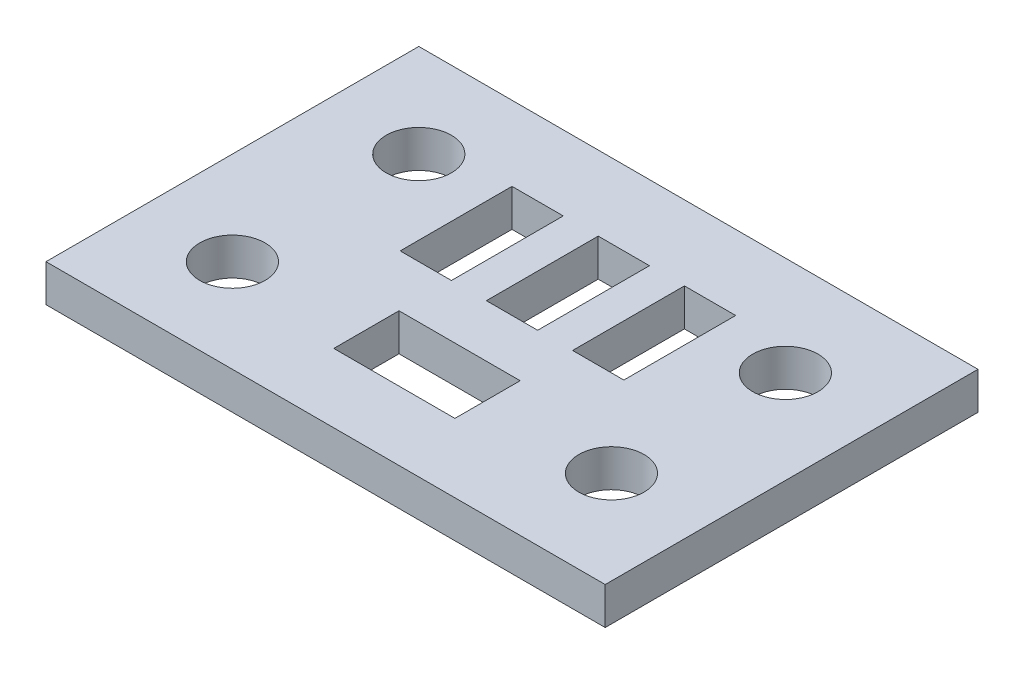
ISO-10303-21;
HEADER;
FILE_DESCRIPTION(('STEP AP214'),'2;1');
FILE_NAME('part.step','',(''),(''),'','','');
FILE_SCHEMA(('AUTOMOTIVE_DESIGN { 1 0 10303 214 1 1 1 1 }'));
ENDSEC;
DATA;
#1=APPLICATION_CONTEXT('core data for automotive mechanical design processes');
#2=APPLICATION_PROTOCOL_DEFINITION('international standard','automotive_design',2000,#1);
#3=PRODUCT_CONTEXT('',#1,'mechanical');
#4=PRODUCT('Part','Part','',(#3));
#5=PRODUCT_RELATED_PRODUCT_CATEGORY('part','',(#4));
#6=PRODUCT_DEFINITION_FORMATION('','',#4);
#7=PRODUCT_DEFINITION_CONTEXT('part definition',#1,'design');
#8=PRODUCT_DEFINITION('design','',#6,#7);
#9=PRODUCT_DEFINITION_SHAPE('','',#8);
#10=(LENGTH_UNIT() NAMED_UNIT(*) SI_UNIT(.MILLI.,.METRE.));
#11=(NAMED_UNIT(*) PLANE_ANGLE_UNIT() SI_UNIT($,.RADIAN.));
#12=(NAMED_UNIT(*) SI_UNIT($,.STERADIAN.) SOLID_ANGLE_UNIT());
#13=UNCERTAINTY_MEASURE_WITH_UNIT(LENGTH_MEASURE(1.E-05),#10,'distance_accuracy_value','');
#14=(GEOMETRIC_REPRESENTATION_CONTEXT(3) GLOBAL_UNCERTAINTY_ASSIGNED_CONTEXT((#13)) GLOBAL_UNIT_ASSIGNED_CONTEXT((#10,
#11,#12)) REPRESENTATION_CONTEXT('',''));
#15=CARTESIAN_POINT('',(0.,0.,0.));
#16=DIRECTION('',(0.,0.,1.));
#17=DIRECTION('',(1.,0.,0.));
#18=AXIS2_PLACEMENT_3D('',#15,#16,#17);
#19=CARTESIAN_POINT('',(0.,2.,0.));
#20=DIRECTION('',(0.,-1.,0.));
#21=DIRECTION('',(0.,0.,-1.));
#22=AXIS2_PLACEMENT_3D('',#19,#20,#21);
#23=PLANE('',#22);
#24=DIRECTION('',(0.,0.,1.));
#25=VECTOR('',#24,1.);
#26=CARTESIAN_POINT('',(11.75,2.,-7.18797813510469));
#27=LINE('',#26,#25);
#28=CARTESIAN_POINT('',(11.75,2.,-7.18797813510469));
#29=VERTEX_POINT('',#28);
#30=CARTESIAN_POINT('',(11.75,2.,-3.68797813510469));
#31=VERTEX_POINT('',#30);
#32=EDGE_CURVE('E206',#29,#31,#27,.T.);
#33=ORIENTED_EDGE('',*,*,#32,.F.);
#34=DIRECTION('',(-1.,0.,0.));
#35=VECTOR('',#34,1.);
#36=CARTESIAN_POINT('',(11.75,2.,-7.18797813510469));
#37=LINE('',#36,#35);
#38=CARTESIAN_POINT('',(18.25,2.,-7.18797813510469));
#39=VERTEX_POINT('',#38);
#40=EDGE_CURVE('E214',#39,#29,#37,.T.);
#41=ORIENTED_EDGE('',*,*,#40,.F.);
#42=DIRECTION('',(0.,0.,-1.));
#43=VECTOR('',#42,1.);
#44=CARTESIAN_POINT('',(18.25,2.,-7.18797813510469));
#45=LINE('',#44,#43);
#46=CARTESIAN_POINT('',(18.25,2.,-3.68797813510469));
#47=VERTEX_POINT('',#46);
#48=EDGE_CURVE('E211',#47,#39,#45,.T.);
#49=ORIENTED_EDGE('',*,*,#48,.F.);
#50=DIRECTION('',(1.,0.,0.));
#51=VECTOR('',#50,1.);
#52=CARTESIAN_POINT('',(11.75,2.,-3.68797813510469));
#53=LINE('',#52,#51);
#54=EDGE_CURVE('E208',#31,#47,#53,.T.);
#55=ORIENTED_EDGE('',*,*,#54,.F.);
#56=EDGE_LOOP('',(#33,#41,#49,#55));
#57=FACE_BOUND('',#56,.T.);
#58=DIRECTION('',(-1.,0.,0.));
#59=VECTOR('',#58,1.);
#60=CARTESIAN_POINT('',(9.,2.,-16.));
#61=LINE('',#60,#59);
#62=CARTESIAN_POINT('',(11.75,2.,-16.));
#63=VERTEX_POINT('',#62);
#64=CARTESIAN_POINT('',(9.,2.,-16.));
#65=VERTEX_POINT('',#64);
#66=EDGE_CURVE('E268',#63,#65,#61,.T.);
#67=ORIENTED_EDGE('',*,*,#66,.F.);
#68=DIRECTION('',(0.,0.,-1.));
#69=VECTOR('',#68,1.);
#70=CARTESIAN_POINT('',(11.75,2.,-10.));
#71=LINE('',#70,#69);
#72=CARTESIAN_POINT('',(11.75,2.,-10.));
#73=VERTEX_POINT('',#72);
#74=EDGE_CURVE('E276',#73,#63,#71,.T.);
#75=ORIENTED_EDGE('',*,*,#74,.F.);
#76=DIRECTION('',(1.,0.,0.));
#77=VECTOR('',#76,1.);
#78=CARTESIAN_POINT('',(11.75,2.,-10.));
#79=LINE('',#78,#77);
#80=CARTESIAN_POINT('',(9.,2.,-10.));
#81=VERTEX_POINT('',#80);
#82=EDGE_CURVE('E273',#81,#73,#79,.T.);
#83=ORIENTED_EDGE('',*,*,#82,.F.);
#84=DIRECTION('',(0.,0.,1.));
#85=VECTOR('',#84,1.);
#86=CARTESIAN_POINT('',(9.,2.,-10.));
#87=LINE('',#86,#85);
#88=EDGE_CURVE('E270',#65,#81,#87,.T.);
#89=ORIENTED_EDGE('',*,*,#88,.F.);
#90=EDGE_LOOP('',(#67,#75,#83,#89));
#91=FACE_BOUND('',#90,.T.);
#92=CARTESIAN_POINT('',(25.,2.,-5.33441582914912));
#93=DIRECTION('',(0.,1.,0.));
#94=DIRECTION('',(0.,0.,1.));
#95=AXIS2_PLACEMENT_3D('',#92,#93,#94);
#96=CIRCLE('',#95,1.75);
#97=CARTESIAN_POINT('',(25.,2.,-3.58441582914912));
#98=VERTEX_POINT('',#97);
#99=EDGE_CURVE('E305',#98,#98,#96,.T.);
#100=ORIENTED_EDGE('',*,*,#99,.F.);
#101=EDGE_LOOP('',(#100));
#102=FACE_BOUND('',#101,.T.);
#103=CARTESIAN_POINT('',(5.,2.,-15.));
#104=DIRECTION('',(0.,1.,0.));
#105=DIRECTION('',(0.,0.,1.));
#106=AXIS2_PLACEMENT_3D('',#103,#104,#105);
#107=CIRCLE('',#106,1.75);
#108=CARTESIAN_POINT('',(5.,2.,-13.25));
#109=VERTEX_POINT('',#108);
#110=EDGE_CURVE('E317',#109,#109,#107,.T.);
#111=ORIENTED_EDGE('',*,*,#110,.F.);
#112=EDGE_LOOP('',(#111));
#113=FACE_BOUND('',#112,.T.);
#114=DIRECTION('',(0.,0.,1.));
#115=VECTOR('',#114,1.);
#116=CARTESIAN_POINT('',(0.,2.,0.));
#117=LINE('',#116,#115);
#118=CARTESIAN_POINT('',(0.,2.,-20.));
#119=VERTEX_POINT('',#118);
#120=CARTESIAN_POINT('',(0.,2.,0.));
#121=VERTEX_POINT('',#120);
#122=EDGE_CURVE('E323',#119,#121,#117,.T.);
#123=ORIENTED_EDGE('',*,*,#122,.T.);
#124=DIRECTION('',(1.,0.,0.));
#125=VECTOR('',#124,1.);
#126=CARTESIAN_POINT('',(0.,2.,0.));
#127=LINE('',#126,#125);
#128=CARTESIAN_POINT('',(30.,2.,0.));
#129=VERTEX_POINT('',#128);
#130=EDGE_CURVE('E326',#121,#129,#127,.T.);
#131=ORIENTED_EDGE('',*,*,#130,.T.);
#132=DIRECTION('',(0.,0.,-1.));
#133=VECTOR('',#132,1.);
#134=CARTESIAN_POINT('',(30.,2.,0.));
#135=LINE('',#134,#133);
#136=CARTESIAN_POINT('',(30.,2.,-20.));
#137=VERTEX_POINT('',#136);
#138=EDGE_CURVE('E329',#129,#137,#135,.T.);
#139=ORIENTED_EDGE('',*,*,#138,.T.);
#140=DIRECTION('',(-1.,0.,0.));
#141=VECTOR('',#140,1.);
#142=CARTESIAN_POINT('',(0.,2.,-20.));
#143=LINE('',#142,#141);
#144=EDGE_CURVE('E331',#137,#119,#143,.T.);
#145=ORIENTED_EDGE('',*,*,#144,.T.);
#146=EDGE_LOOP('',(#123,#131,#139,#145));
#147=FACE_BOUND('',#146,.T.);
#148=CARTESIAN_POINT('',(25.,2.,-14.6655841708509));
#149=DIRECTION('',(0.,1.,0.));
#150=DIRECTION('',(0.,0.,-1.));
#151=AXIS2_PLACEMENT_3D('',#148,#149,#150);
#152=CIRCLE('',#151,1.75);
#153=CARTESIAN_POINT('',(25.,2.,-16.4155841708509));
#154=VERTEX_POINT('',#153);
#155=EDGE_CURVE('E311',#154,#154,#152,.T.);
#156=ORIENTED_EDGE('',*,*,#155,.F.);
#157=EDGE_LOOP('',(#156));
#158=FACE_BOUND('',#157,.T.);
#159=CARTESIAN_POINT('',(5.,2.,-5.));
#160=DIRECTION('',(0.,1.,0.));
#161=DIRECTION('',(0.,0.,-1.));
#162=AXIS2_PLACEMENT_3D('',#159,#160,#161);
#163=CIRCLE('',#162,1.75);
#164=CARTESIAN_POINT('',(5.,2.,-6.75));
#165=VERTEX_POINT('',#164);
#166=EDGE_CURVE('E299',#165,#165,#163,.T.);
#167=ORIENTED_EDGE('',*,*,#166,.F.);
#168=EDGE_LOOP('',(#167));
#169=FACE_BOUND('',#168,.T.);
#170=DIRECTION('',(1.,0.,0.));
#171=VECTOR('',#170,1.);
#172=CARTESIAN_POINT('',(18.25,2.,-10.));
#173=LINE('',#172,#171);
#174=CARTESIAN_POINT('',(18.25,2.,-10.));
#175=VERTEX_POINT('',#174);
#176=CARTESIAN_POINT('',(21.,2.,-10.));
#177=VERTEX_POINT('',#176);
#178=EDGE_CURVE('E237',#175,#177,#173,.T.);
#179=ORIENTED_EDGE('',*,*,#178,.F.);
#180=DIRECTION('',(0.,0.,1.));
#181=VECTOR('',#180,1.);
#182=CARTESIAN_POINT('',(18.25,2.,-10.));
#183=LINE('',#182,#181);
#184=CARTESIAN_POINT('',(18.25,2.,-16.));
#185=VERTEX_POINT('',#184);
#186=EDGE_CURVE('E245',#185,#175,#183,.T.);
#187=ORIENTED_EDGE('',*,*,#186,.F.);
#188=DIRECTION('',(-1.,0.,0.));
#189=VECTOR('',#188,1.);
#190=CARTESIAN_POINT('',(18.25,2.,-16.));
#191=LINE('',#190,#189);
#192=CARTESIAN_POINT('',(21.,2.,-16.));
#193=VERTEX_POINT('',#192);
#194=EDGE_CURVE('E242',#193,#185,#191,.T.);
#195=ORIENTED_EDGE('',*,*,#194,.F.);
#196=DIRECTION('',(0.,0.,-1.));
#197=VECTOR('',#196,1.);
#198=CARTESIAN_POINT('',(21.,2.,-16.));
#199=LINE('',#198,#197);
#200=EDGE_CURVE('E239',#177,#193,#199,.T.);
#201=ORIENTED_EDGE('',*,*,#200,.F.);
#202=EDGE_LOOP('',(#179,#187,#195,#201));
#203=FACE_BOUND('',#202,.T.);
#204=DIRECTION('',(1.,0.,0.));
#205=VECTOR('',#204,1.);
#206=CARTESIAN_POINT('',(13.625,2.,-10.));
#207=LINE('',#206,#205);
#208=CARTESIAN_POINT('',(13.625,2.,-10.));
#209=VERTEX_POINT('',#208);
#210=CARTESIAN_POINT('',(16.375,2.,-10.));
#211=VERTEX_POINT('',#210);
#212=EDGE_CURVE('E170',#209,#211,#207,.T.);
#213=ORIENTED_EDGE('',*,*,#212,.F.);
#214=DIRECTION('',(0.,0.,1.));
#215=VECTOR('',#214,1.);
#216=CARTESIAN_POINT('',(13.625,2.,-10.));
#217=LINE('',#216,#215);
#218=CARTESIAN_POINT('',(13.625,2.,-16.));
#219=VERTEX_POINT('',#218);
#220=EDGE_CURVE('E192',#219,#209,#217,.T.);
#221=ORIENTED_EDGE('',*,*,#220,.F.);
#222=DIRECTION('',(-1.,0.,0.));
#223=VECTOR('',#222,1.);
#224=CARTESIAN_POINT('',(13.625,2.,-16.));
#225=LINE('',#224,#223);
#226=CARTESIAN_POINT('',(16.375,2.,-16.));
#227=VERTEX_POINT('',#226);
#228=EDGE_CURVE('E190',#227,#219,#225,.T.);
#229=ORIENTED_EDGE('',*,*,#228,.F.);
#230=DIRECTION('',(0.,0.,-1.));
#231=VECTOR('',#230,1.);
#232=CARTESIAN_POINT('',(16.375,2.,-10.));
#233=LINE('',#232,#231);
#234=EDGE_CURVE('E178',#211,#227,#233,.T.);
#235=ORIENTED_EDGE('',*,*,#234,.F.);
#236=EDGE_LOOP('',(#213,#221,#229,#235));
#237=FACE_BOUND('',#236,.T.);
#238=ADVANCED_FACE('F33',(#57,#91,#102,#113,#147,#158,#169,#203,#237),#23,.F.);
#239=CARTESIAN_POINT('',(0.,0.,0.));
#240=DIRECTION('',(0.,-1.,0.));
#241=DIRECTION('',(0.,0.,-1.));
#242=AXIS2_PLACEMENT_3D('',#239,#240,#241);
#243=PLANE('',#242);
#244=DIRECTION('',(-1.,0.,0.));
#245=VECTOR('',#244,1.);
#246=CARTESIAN_POINT('',(11.75,0.,-7.18797813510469));
#247=LINE('',#246,#245);
#248=CARTESIAN_POINT('',(18.25,0.,-7.18797813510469));
#249=VERTEX_POINT('',#248);
#250=CARTESIAN_POINT('',(11.75,0.,-7.18797813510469));
#251=VERTEX_POINT('',#250);
#252=EDGE_CURVE('E209',#249,#251,#247,.T.);
#253=ORIENTED_EDGE('',*,*,#252,.T.);
#254=DIRECTION('',(0.,0.,1.));
#255=VECTOR('',#254,1.);
#256=CARTESIAN_POINT('',(11.75,0.,-7.18797813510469));
#257=LINE('',#256,#255);
#258=CARTESIAN_POINT('',(11.75,0.,-3.68797813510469));
#259=VERTEX_POINT('',#258);
#260=EDGE_CURVE('E186',#251,#259,#257,.T.);
#261=ORIENTED_EDGE('',*,*,#260,.T.);
#262=DIRECTION('',(1.,0.,0.));
#263=VECTOR('',#262,1.);
#264=CARTESIAN_POINT('',(11.75,0.,-3.68797813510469));
#265=LINE('',#264,#263);
#266=CARTESIAN_POINT('',(18.25,0.,-3.68797813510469));
#267=VERTEX_POINT('',#266);
#268=EDGE_CURVE('E219',#259,#267,#265,.T.);
#269=ORIENTED_EDGE('',*,*,#268,.T.);
#270=DIRECTION('',(0.,0.,-1.));
#271=VECTOR('',#270,1.);
#272=CARTESIAN_POINT('',(18.25,0.,-7.18797813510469));
#273=LINE('',#272,#271);
#274=EDGE_CURVE('E222',#267,#249,#273,.T.);
#275=ORIENTED_EDGE('',*,*,#274,.T.);
#276=EDGE_LOOP('',(#253,#261,#269,#275));
#277=FACE_BOUND('',#276,.T.);
#278=DIRECTION('',(0.,0.,-1.));
#279=VECTOR('',#278,1.);
#280=CARTESIAN_POINT('',(11.75,0.,-10.));
#281=LINE('',#280,#279);
#282=CARTESIAN_POINT('',(11.75,0.,-10.));
#283=VERTEX_POINT('',#282);
#284=CARTESIAN_POINT('',(11.75,0.,-16.));
#285=VERTEX_POINT('',#284);
#286=EDGE_CURVE('E271',#283,#285,#281,.T.);
#287=ORIENTED_EDGE('',*,*,#286,.T.);
#288=DIRECTION('',(-1.,0.,0.));
#289=VECTOR('',#288,1.);
#290=CARTESIAN_POINT('',(9.,0.,-16.));
#291=LINE('',#290,#289);
#292=CARTESIAN_POINT('',(9.,0.,-16.));
#293=VERTEX_POINT('',#292);
#294=EDGE_CURVE('E267',#285,#293,#291,.T.);
#295=ORIENTED_EDGE('',*,*,#294,.T.);
#296=DIRECTION('',(0.,0.,1.));
#297=VECTOR('',#296,1.);
#298=CARTESIAN_POINT('',(9.,0.,-10.));
#299=LINE('',#298,#297);
#300=CARTESIAN_POINT('',(9.,0.,-10.));
#301=VERTEX_POINT('',#300);
#302=EDGE_CURVE('E281',#293,#301,#299,.T.);
#303=ORIENTED_EDGE('',*,*,#302,.T.);
#304=DIRECTION('',(1.,0.,0.));
#305=VECTOR('',#304,1.);
#306=CARTESIAN_POINT('',(11.75,0.,-10.));
#307=LINE('',#306,#305);
#308=EDGE_CURVE('E284',#301,#283,#307,.T.);
#309=ORIENTED_EDGE('',*,*,#308,.T.);
#310=EDGE_LOOP('',(#287,#295,#303,#309));
#311=FACE_BOUND('',#310,.T.);
#312=CARTESIAN_POINT('',(25.,0.,-5.33441582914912));
#313=DIRECTION('',(0.,1.,0.));
#314=DIRECTION('',(0.,0.,1.));
#315=AXIS2_PLACEMENT_3D('',#312,#313,#314);
#316=CIRCLE('',#315,1.75);
#317=CARTESIAN_POINT('',(25.,0.,-3.58441582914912));
#318=VERTEX_POINT('',#317);
#319=EDGE_CURVE('E302',#318,#318,#316,.T.);
#320=ORIENTED_EDGE('',*,*,#319,.T.);
#321=EDGE_LOOP('',(#320));
#322=FACE_BOUND('',#321,.T.);
#323=CARTESIAN_POINT('',(5.,0.,-15.));
#324=DIRECTION('',(0.,1.,0.));
#325=DIRECTION('',(0.,0.,1.));
#326=AXIS2_PLACEMENT_3D('',#323,#324,#325);
#327=CIRCLE('',#326,1.75);
#328=CARTESIAN_POINT('',(5.,0.,-13.25));
#329=VERTEX_POINT('',#328);
#330=EDGE_CURVE('E314',#329,#329,#327,.T.);
#331=ORIENTED_EDGE('',*,*,#330,.T.);
#332=EDGE_LOOP('',(#331));
#333=FACE_BOUND('',#332,.T.);
#334=DIRECTION('',(0.,0.,1.));
#335=VECTOR('',#334,1.);
#336=CARTESIAN_POINT('',(0.,0.,0.));
#337=LINE('',#336,#335);
#338=CARTESIAN_POINT('',(0.,0.,-20.));
#339=VERTEX_POINT('',#338);
#340=CARTESIAN_POINT('',(0.,0.,0.));
#341=VERTEX_POINT('',#340);
#342=EDGE_CURVE('E320',#339,#341,#337,.T.);
#343=ORIENTED_EDGE('',*,*,#342,.F.);
#344=DIRECTION('',(-1.,0.,0.));
#345=VECTOR('',#344,1.);
#346=CARTESIAN_POINT('',(0.,0.,-20.));
#347=LINE('',#346,#345);
#348=CARTESIAN_POINT('',(30.,0.,-20.));
#349=VERTEX_POINT('',#348);
#350=EDGE_CURVE('E327',#349,#339,#347,.T.);
#351=ORIENTED_EDGE('',*,*,#350,.F.);
#352=DIRECTION('',(0.,0.,-1.));
#353=VECTOR('',#352,1.);
#354=CARTESIAN_POINT('',(30.,0.,0.));
#355=LINE('',#354,#353);
#356=CARTESIAN_POINT('',(30.,0.,0.));
#357=VERTEX_POINT('',#356);
#358=EDGE_CURVE('E338',#357,#349,#355,.T.);
#359=ORIENTED_EDGE('',*,*,#358,.F.);
#360=DIRECTION('',(1.,0.,0.));
#361=VECTOR('',#360,1.);
#362=CARTESIAN_POINT('',(0.,0.,0.));
#363=LINE('',#362,#361);
#364=EDGE_CURVE('E336',#341,#357,#363,.T.);
#365=ORIENTED_EDGE('',*,*,#364,.F.);
#366=EDGE_LOOP('',(#343,#351,#359,#365));
#367=FACE_BOUND('',#366,.T.);
#368=CARTESIAN_POINT('',(25.,0.,-14.6655841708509));
#369=DIRECTION('',(0.,1.,0.));
#370=DIRECTION('',(0.,0.,-1.));
#371=AXIS2_PLACEMENT_3D('',#368,#369,#370);
#372=CIRCLE('',#371,1.75);
#373=CARTESIAN_POINT('',(25.,0.,-16.4155841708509));
#374=VERTEX_POINT('',#373);
#375=EDGE_CURVE('E308',#374,#374,#372,.T.);
#376=ORIENTED_EDGE('',*,*,#375,.T.);
#377=EDGE_LOOP('',(#376));
#378=FACE_BOUND('',#377,.T.);
#379=CARTESIAN_POINT('',(5.,0.,-5.));
#380=DIRECTION('',(0.,1.,0.));
#381=DIRECTION('',(0.,0.,-1.));
#382=AXIS2_PLACEMENT_3D('',#379,#380,#381);
#383=CIRCLE('',#382,1.75);
#384=CARTESIAN_POINT('',(5.,0.,-6.75));
#385=VERTEX_POINT('',#384);
#386=EDGE_CURVE('E298',#385,#385,#383,.T.);
#387=ORIENTED_EDGE('',*,*,#386,.T.);
#388=EDGE_LOOP('',(#387));
#389=FACE_BOUND('',#388,.T.);
#390=DIRECTION('',(0.,0.,1.));
#391=VECTOR('',#390,1.);
#392=CARTESIAN_POINT('',(18.25,0.,-10.));
#393=LINE('',#392,#391);
#394=CARTESIAN_POINT('',(18.25,0.,-16.));
#395=VERTEX_POINT('',#394);
#396=CARTESIAN_POINT('',(18.25,0.,-10.));
#397=VERTEX_POINT('',#396);
#398=EDGE_CURVE('E240',#395,#397,#393,.T.);
#399=ORIENTED_EDGE('',*,*,#398,.T.);
#400=DIRECTION('',(1.,0.,0.));
#401=VECTOR('',#400,1.);
#402=CARTESIAN_POINT('',(18.25,0.,-10.));
#403=LINE('',#402,#401);
#404=CARTESIAN_POINT('',(21.,0.,-10.));
#405=VERTEX_POINT('',#404);
#406=EDGE_CURVE('E236',#397,#405,#403,.T.);
#407=ORIENTED_EDGE('',*,*,#406,.T.);
#408=DIRECTION('',(0.,0.,-1.));
#409=VECTOR('',#408,1.);
#410=CARTESIAN_POINT('',(21.,0.,-16.));
#411=LINE('',#410,#409);
#412=CARTESIAN_POINT('',(21.,0.,-16.));
#413=VERTEX_POINT('',#412);
#414=EDGE_CURVE('E250',#405,#413,#411,.T.);
#415=ORIENTED_EDGE('',*,*,#414,.T.);
#416=DIRECTION('',(-1.,0.,0.));
#417=VECTOR('',#416,1.);
#418=CARTESIAN_POINT('',(18.25,0.,-16.));
#419=LINE('',#418,#417);
#420=EDGE_CURVE('E253',#413,#395,#419,.T.);
#421=ORIENTED_EDGE('',*,*,#420,.T.);
#422=EDGE_LOOP('',(#399,#407,#415,#421));
#423=FACE_BOUND('',#422,.T.);
#424=DIRECTION('',(0.,0.,1.));
#425=VECTOR('',#424,1.);
#426=CARTESIAN_POINT('',(13.625,0.,-10.));
#427=LINE('',#426,#425);
#428=CARTESIAN_POINT('',(13.625,0.,-16.));
#429=VERTEX_POINT('',#428);
#430=CARTESIAN_POINT('',(13.625,0.,-10.));
#431=VERTEX_POINT('',#430);
#432=EDGE_CURVE('E179',#429,#431,#427,.T.);
#433=ORIENTED_EDGE('',*,*,#432,.T.);
#434=DIRECTION('',(1.,0.,0.));
#435=VECTOR('',#434,1.);
#436=CARTESIAN_POINT('',(13.625,0.,-10.));
#437=LINE('',#436,#435);
#438=CARTESIAN_POINT('',(16.375,0.,-10.));
#439=VERTEX_POINT('',#438);
#440=EDGE_CURVE('E56',#431,#439,#437,.T.);
#441=ORIENTED_EDGE('',*,*,#440,.T.);
#442=DIRECTION('',(0.,0.,-1.));
#443=VECTOR('',#442,1.);
#444=CARTESIAN_POINT('',(16.375,0.,-10.));
#445=LINE('',#444,#443);
#446=CARTESIAN_POINT('',(16.375,0.,-16.));
#447=VERTEX_POINT('',#446);
#448=EDGE_CURVE('E185',#439,#447,#445,.T.);
#449=ORIENTED_EDGE('',*,*,#448,.T.);
#450=DIRECTION('',(-1.,0.,0.));
#451=VECTOR('',#450,1.);
#452=CARTESIAN_POINT('',(13.625,0.,-16.));
#453=LINE('',#452,#451);
#454=EDGE_CURVE('E198',#447,#429,#453,.T.);
#455=ORIENTED_EDGE('',*,*,#454,.T.);
#456=EDGE_LOOP('',(#433,#441,#449,#455));
#457=FACE_BOUND('',#456,.T.);
#458=ADVANCED_FACE('F356',(#277,#311,#322,#333,#367,#378,#389,#423,#457),#243,.T.);
#459=CARTESIAN_POINT('',(0.,2.,0.));
#460=DIRECTION('',(1.,0.,0.));
#461=DIRECTION('',(0.,0.,-1.));
#462=AXIS2_PLACEMENT_3D('',#459,#460,#461);
#463=PLANE('',#462);
#464=ORIENTED_EDGE('',*,*,#342,.T.);
#465=DIRECTION('',(0.,-1.,0.));
#466=VECTOR('',#465,1.);
#467=CARTESIAN_POINT('',(0.,2.,0.));
#468=LINE('',#467,#466);
#469=EDGE_CURVE('E11',#121,#341,#468,.T.);
#470=ORIENTED_EDGE('',*,*,#469,.F.);
#471=ORIENTED_EDGE('',*,*,#122,.F.);
#472=DIRECTION('',(0.,-1.,0.));
#473=VECTOR('',#472,1.);
#474=CARTESIAN_POINT('',(0.,2.,-20.));
#475=LINE('',#474,#473);
#476=EDGE_CURVE('E333',#119,#339,#475,.T.);
#477=ORIENTED_EDGE('',*,*,#476,.T.);
#478=EDGE_LOOP('',(#464,#470,#471,#477));
#479=FACE_BOUND('',#478,.T.);
#480=ADVANCED_FACE('F35',(#479),#463,.F.);
#481=CARTESIAN_POINT('',(0.,2.,0.));
#482=DIRECTION('',(0.,0.,-1.));
#483=DIRECTION('',(-1.,0.,0.));
#484=AXIS2_PLACEMENT_3D('',#481,#482,#483);
#485=PLANE('',#484);
#486=ORIENTED_EDGE('',*,*,#364,.T.);
#487=DIRECTION('',(0.,-1.,0.));
#488=VECTOR('',#487,1.);
#489=CARTESIAN_POINT('',(30.,2.,0.));
#490=LINE('',#489,#488);
#491=EDGE_CURVE('E41',#129,#357,#490,.T.);
#492=ORIENTED_EDGE('',*,*,#491,.F.);
#493=ORIENTED_EDGE('',*,*,#130,.F.);
#494=ORIENTED_EDGE('',*,*,#469,.T.);
#495=EDGE_LOOP('',(#486,#492,#493,#494));
#496=FACE_BOUND('',#495,.T.);
#497=ADVANCED_FACE('F367',(#496),#485,.F.);
#498=CARTESIAN_POINT('',(30.,2.,0.));
#499=DIRECTION('',(-1.,0.,0.));
#500=DIRECTION('',(0.,0.,1.));
#501=AXIS2_PLACEMENT_3D('',#498,#499,#500);
#502=PLANE('',#501);
#503=ORIENTED_EDGE('',*,*,#358,.T.);
#504=DIRECTION('',(0.,-1.,0.));
#505=VECTOR('',#504,1.);
#506=CARTESIAN_POINT('',(30.,2.,-20.));
#507=LINE('',#506,#505);
#508=EDGE_CURVE('E343',#137,#349,#507,.T.);
#509=ORIENTED_EDGE('',*,*,#508,.F.);
#510=ORIENTED_EDGE('',*,*,#138,.F.);
#511=ORIENTED_EDGE('',*,*,#491,.T.);
#512=EDGE_LOOP('',(#503,#509,#510,#511));
#513=FACE_BOUND('',#512,.T.);
#514=ADVANCED_FACE('F350',(#513),#502,.F.);
#515=CARTESIAN_POINT('',(0.,2.,-20.));
#516=DIRECTION('',(0.,0.,1.));
#517=DIRECTION('',(1.,0.,0.));
#518=AXIS2_PLACEMENT_3D('',#515,#516,#517);
#519=PLANE('',#518);
#520=ORIENTED_EDGE('',*,*,#350,.T.);
#521=ORIENTED_EDGE('',*,*,#476,.F.);
#522=ORIENTED_EDGE('',*,*,#144,.F.);
#523=ORIENTED_EDGE('',*,*,#508,.T.);
#524=EDGE_LOOP('',(#520,#521,#522,#523));
#525=FACE_BOUND('',#524,.T.);
#526=ADVANCED_FACE('F360',(#525),#519,.F.);
#527=CARTESIAN_POINT('',(5.,2.,-15.));
#528=DIRECTION('',(0.,-1.,0.));
#529=DIRECTION('',(0.,0.,-1.));
#530=AXIS2_PLACEMENT_3D('',#527,#528,#529);
#531=CYLINDRICAL_SURFACE('',#530,1.75);
#532=ORIENTED_EDGE('',*,*,#110,.T.);
#533=EDGE_LOOP('',(#532));
#534=FACE_BOUND('',#533,.T.);
#535=ORIENTED_EDGE('',*,*,#330,.F.);
#536=EDGE_LOOP('',(#535));
#537=FACE_BOUND('',#536,.T.);
#538=ADVANCED_FACE('F385',(#534,#537),#531,.F.);
#539=CARTESIAN_POINT('',(25.,2.,-14.6655841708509));
#540=DIRECTION('',(0.,-1.,0.));
#541=DIRECTION('',(0.,0.,-1.));
#542=AXIS2_PLACEMENT_3D('',#539,#540,#541);
#543=CYLINDRICAL_SURFACE('',#542,1.75);
#544=ORIENTED_EDGE('',*,*,#155,.T.);
#545=EDGE_LOOP('',(#544));
#546=FACE_BOUND('',#545,.T.);
#547=ORIENTED_EDGE('',*,*,#375,.F.);
#548=EDGE_LOOP('',(#547));
#549=FACE_BOUND('',#548,.T.);
#550=ADVANCED_FACE('F392',(#546,#549),#543,.F.);
#551=CARTESIAN_POINT('',(25.,2.,-5.33441582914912));
#552=DIRECTION('',(0.,-1.,0.));
#553=DIRECTION('',(0.,0.,-1.));
#554=AXIS2_PLACEMENT_3D('',#551,#552,#553);
#555=CYLINDRICAL_SURFACE('',#554,1.75);
#556=ORIENTED_EDGE('',*,*,#99,.T.);
#557=EDGE_LOOP('',(#556));
#558=FACE_BOUND('',#557,.T.);
#559=ORIENTED_EDGE('',*,*,#319,.F.);
#560=EDGE_LOOP('',(#559));
#561=FACE_BOUND('',#560,.T.);
#562=ADVANCED_FACE('F397',(#558,#561),#555,.F.);
#563=CARTESIAN_POINT('',(5.,2.,-5.));
#564=DIRECTION('',(0.,-1.,0.));
#565=DIRECTION('',(0.,0.,-1.));
#566=AXIS2_PLACEMENT_3D('',#563,#564,#565);
#567=CYLINDRICAL_SURFACE('',#566,1.75);
#568=ORIENTED_EDGE('',*,*,#166,.T.);
#569=EDGE_LOOP('',(#568));
#570=FACE_BOUND('',#569,.T.);
#571=ORIENTED_EDGE('',*,*,#386,.F.);
#572=EDGE_LOOP('',(#571));
#573=FACE_BOUND('',#572,.T.);
#574=ADVANCED_FACE('F407',(#570,#573),#567,.F.);
#575=CARTESIAN_POINT('',(9.,2.,-16.));
#576=DIRECTION('',(0.,0.,1.));
#577=DIRECTION('',(1.,0.,0.));
#578=AXIS2_PLACEMENT_3D('',#575,#576,#577);
#579=PLANE('',#578);
#580=ORIENTED_EDGE('',*,*,#294,.F.);
#581=DIRECTION('',(0.,-1.,0.));
#582=VECTOR('',#581,1.);
#583=CARTESIAN_POINT('',(11.75,2.,-16.));
#584=LINE('',#583,#582);
#585=EDGE_CURVE('E278',#63,#285,#584,.T.);
#586=ORIENTED_EDGE('',*,*,#585,.F.);
#587=ORIENTED_EDGE('',*,*,#66,.T.);
#588=DIRECTION('',(0.,-1.,0.));
#589=VECTOR('',#588,1.);
#590=CARTESIAN_POINT('',(9.,2.,-16.));
#591=LINE('',#590,#589);
#592=EDGE_CURVE('E295',#65,#293,#591,.T.);
#593=ORIENTED_EDGE('',*,*,#592,.T.);
#594=EDGE_LOOP('',(#580,#586,#587,#593));
#595=FACE_BOUND('',#594,.T.);
#596=ADVANCED_FACE('F414',(#595),#579,.T.);
#597=CARTESIAN_POINT('',(9.,2.,-10.));
#598=DIRECTION('',(1.,0.,0.));
#599=DIRECTION('',(0.,0.,-1.));
#600=AXIS2_PLACEMENT_3D('',#597,#598,#599);
#601=PLANE('',#600);
#602=ORIENTED_EDGE('',*,*,#302,.F.);
#603=ORIENTED_EDGE('',*,*,#592,.F.);
#604=ORIENTED_EDGE('',*,*,#88,.T.);
#605=DIRECTION('',(0.,-1.,0.));
#606=VECTOR('',#605,1.);
#607=CARTESIAN_POINT('',(9.,2.,-10.));
#608=LINE('',#607,#606);
#609=EDGE_CURVE('E293',#81,#301,#608,.T.);
#610=ORIENTED_EDGE('',*,*,#609,.T.);
#611=EDGE_LOOP('',(#602,#603,#604,#610));
#612=FACE_BOUND('',#611,.T.);
#613=ADVANCED_FACE('F418',(#612),#601,.T.);
#614=CARTESIAN_POINT('',(11.75,2.,-10.));
#615=DIRECTION('',(0.,0.,-1.));
#616=DIRECTION('',(-1.,0.,0.));
#617=AXIS2_PLACEMENT_3D('',#614,#615,#616);
#618=PLANE('',#617);
#619=ORIENTED_EDGE('',*,*,#308,.F.);
#620=ORIENTED_EDGE('',*,*,#609,.F.);
#621=ORIENTED_EDGE('',*,*,#82,.T.);
#622=DIRECTION('',(0.,-1.,0.));
#623=VECTOR('',#622,1.);
#624=CARTESIAN_POINT('',(11.75,2.,-10.));
#625=LINE('',#624,#623);
#626=EDGE_CURVE('E291',#73,#283,#625,.T.);
#627=ORIENTED_EDGE('',*,*,#626,.T.);
#628=EDGE_LOOP('',(#619,#620,#621,#627));
#629=FACE_BOUND('',#628,.T.);
#630=ADVANCED_FACE('F422',(#629),#618,.T.);
#631=CARTESIAN_POINT('',(11.75,2.,-10.));
#632=DIRECTION('',(-1.,0.,0.));
#633=DIRECTION('',(0.,0.,1.));
#634=AXIS2_PLACEMENT_3D('',#631,#632,#633);
#635=PLANE('',#634);
#636=ORIENTED_EDGE('',*,*,#286,.F.);
#637=ORIENTED_EDGE('',*,*,#626,.F.);
#638=ORIENTED_EDGE('',*,*,#74,.T.);
#639=ORIENTED_EDGE('',*,*,#585,.T.);
#640=EDGE_LOOP('',(#636,#637,#638,#639));
#641=FACE_BOUND('',#640,.T.);
#642=ADVANCED_FACE('F426',(#641),#635,.T.);
#643=CARTESIAN_POINT('',(18.25,2.,-10.));
#644=DIRECTION('',(0.,0.,-1.));
#645=DIRECTION('',(-1.,0.,0.));
#646=AXIS2_PLACEMENT_3D('',#643,#644,#645);
#647=PLANE('',#646);
#648=ORIENTED_EDGE('',*,*,#406,.F.);
#649=DIRECTION('',(0.,-1.,0.));
#650=VECTOR('',#649,1.);
#651=CARTESIAN_POINT('',(18.25,2.,-10.));
#652=LINE('',#651,#650);
#653=EDGE_CURVE('E247',#175,#397,#652,.T.);
#654=ORIENTED_EDGE('',*,*,#653,.F.);
#655=ORIENTED_EDGE('',*,*,#178,.T.);
#656=DIRECTION('',(0.,-1.,0.));
#657=VECTOR('',#656,1.);
#658=CARTESIAN_POINT('',(21.,2.,-10.));
#659=LINE('',#658,#657);
#660=EDGE_CURVE('E264',#177,#405,#659,.T.);
#661=ORIENTED_EDGE('',*,*,#660,.T.);
#662=EDGE_LOOP('',(#648,#654,#655,#661));
#663=FACE_BOUND('',#662,.T.);
#664=ADVANCED_FACE('F430',(#663),#647,.T.);
#665=CARTESIAN_POINT('',(21.,2.,-16.));
#666=DIRECTION('',(-1.,0.,0.));
#667=DIRECTION('',(0.,0.,1.));
#668=AXIS2_PLACEMENT_3D('',#665,#666,#667);
#669=PLANE('',#668);
#670=ORIENTED_EDGE('',*,*,#414,.F.);
#671=ORIENTED_EDGE('',*,*,#660,.F.);
#672=ORIENTED_EDGE('',*,*,#200,.T.);
#673=DIRECTION('',(0.,-1.,0.));
#674=VECTOR('',#673,1.);
#675=CARTESIAN_POINT('',(21.,2.,-16.));
#676=LINE('',#675,#674);
#677=EDGE_CURVE('E262',#193,#413,#676,.T.);
#678=ORIENTED_EDGE('',*,*,#677,.T.);
#679=EDGE_LOOP('',(#670,#671,#672,#678));
#680=FACE_BOUND('',#679,.T.);
#681=ADVANCED_FACE('F434',(#680),#669,.T.);
#682=CARTESIAN_POINT('',(18.25,2.,-16.));
#683=DIRECTION('',(0.,0.,1.));
#684=DIRECTION('',(1.,0.,0.));
#685=AXIS2_PLACEMENT_3D('',#682,#683,#684);
#686=PLANE('',#685);
#687=ORIENTED_EDGE('',*,*,#420,.F.);
#688=ORIENTED_EDGE('',*,*,#677,.F.);
#689=ORIENTED_EDGE('',*,*,#194,.T.);
#690=DIRECTION('',(0.,-1.,0.));
#691=VECTOR('',#690,1.);
#692=CARTESIAN_POINT('',(18.25,2.,-16.));
#693=LINE('',#692,#691);
#694=EDGE_CURVE('E260',#185,#395,#693,.T.);
#695=ORIENTED_EDGE('',*,*,#694,.T.);
#696=EDGE_LOOP('',(#687,#688,#689,#695));
#697=FACE_BOUND('',#696,.T.);
#698=ADVANCED_FACE('F438',(#697),#686,.T.);
#699=CARTESIAN_POINT('',(18.25,2.,-10.));
#700=DIRECTION('',(1.,0.,0.));
#701=DIRECTION('',(0.,0.,-1.));
#702=AXIS2_PLACEMENT_3D('',#699,#700,#701);
#703=PLANE('',#702);
#704=ORIENTED_EDGE('',*,*,#398,.F.);
#705=ORIENTED_EDGE('',*,*,#694,.F.);
#706=ORIENTED_EDGE('',*,*,#186,.T.);
#707=ORIENTED_EDGE('',*,*,#653,.T.);
#708=EDGE_LOOP('',(#704,#705,#706,#707));
#709=FACE_BOUND('',#708,.T.);
#710=ADVANCED_FACE('F442',(#709),#703,.T.);
#711=CARTESIAN_POINT('',(11.75,2.,-7.18797813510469));
#712=DIRECTION('',(1.,0.,0.));
#713=DIRECTION('',(0.,0.,-1.));
#714=AXIS2_PLACEMENT_3D('',#711,#712,#713);
#715=PLANE('',#714);
#716=ORIENTED_EDGE('',*,*,#260,.F.);
#717=DIRECTION('',(0.,-1.,0.));
#718=VECTOR('',#717,1.);
#719=CARTESIAN_POINT('',(11.75,2.,-7.18797813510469));
#720=LINE('',#719,#718);
#721=EDGE_CURVE('E216',#29,#251,#720,.T.);
#722=ORIENTED_EDGE('',*,*,#721,.F.);
#723=ORIENTED_EDGE('',*,*,#32,.T.);
#724=DIRECTION('',(0.,-1.,0.));
#725=VECTOR('',#724,1.);
#726=CARTESIAN_POINT('',(11.75,2.,-3.68797813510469));
#727=LINE('',#726,#725);
#728=EDGE_CURVE('E233',#31,#259,#727,.T.);
#729=ORIENTED_EDGE('',*,*,#728,.T.);
#730=EDGE_LOOP('',(#716,#722,#723,#729));
#731=FACE_BOUND('',#730,.T.);
#732=ADVANCED_FACE('F446',(#731),#715,.T.);
#733=CARTESIAN_POINT('',(11.75,2.,-3.68797813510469));
#734=DIRECTION('',(0.,0.,-1.));
#735=DIRECTION('',(-1.,0.,0.));
#736=AXIS2_PLACEMENT_3D('',#733,#734,#735);
#737=PLANE('',#736);
#738=ORIENTED_EDGE('',*,*,#268,.F.);
#739=ORIENTED_EDGE('',*,*,#728,.F.);
#740=ORIENTED_EDGE('',*,*,#54,.T.);
#741=DIRECTION('',(0.,-1.,0.));
#742=VECTOR('',#741,1.);
#743=CARTESIAN_POINT('',(18.25,2.,-3.68797813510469));
#744=LINE('',#743,#742);
#745=EDGE_CURVE('E231',#47,#267,#744,.T.);
#746=ORIENTED_EDGE('',*,*,#745,.T.);
#747=EDGE_LOOP('',(#738,#739,#740,#746));
#748=FACE_BOUND('',#747,.T.);
#749=ADVANCED_FACE('F450',(#748),#737,.T.);
#750=CARTESIAN_POINT('',(18.25,2.,-7.18797813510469));
#751=DIRECTION('',(-1.,0.,0.));
#752=DIRECTION('',(0.,0.,1.));
#753=AXIS2_PLACEMENT_3D('',#750,#751,#752);
#754=PLANE('',#753);
#755=ORIENTED_EDGE('',*,*,#274,.F.);
#756=ORIENTED_EDGE('',*,*,#745,.F.);
#757=ORIENTED_EDGE('',*,*,#48,.T.);
#758=DIRECTION('',(0.,-1.,0.));
#759=VECTOR('',#758,1.);
#760=CARTESIAN_POINT('',(18.25,2.,-7.18797813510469));
#761=LINE('',#760,#759);
#762=EDGE_CURVE('E229',#39,#249,#761,.T.);
#763=ORIENTED_EDGE('',*,*,#762,.T.);
#764=EDGE_LOOP('',(#755,#756,#757,#763));
#765=FACE_BOUND('',#764,.T.);
#766=ADVANCED_FACE('F454',(#765),#754,.T.);
#767=CARTESIAN_POINT('',(11.75,2.,-7.18797813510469));
#768=DIRECTION('',(0.,0.,1.));
#769=DIRECTION('',(1.,0.,0.));
#770=AXIS2_PLACEMENT_3D('',#767,#768,#769);
#771=PLANE('',#770);
#772=ORIENTED_EDGE('',*,*,#252,.F.);
#773=ORIENTED_EDGE('',*,*,#762,.F.);
#774=ORIENTED_EDGE('',*,*,#40,.T.);
#775=ORIENTED_EDGE('',*,*,#721,.T.);
#776=EDGE_LOOP('',(#772,#773,#774,#775));
#777=FACE_BOUND('',#776,.T.);
#778=ADVANCED_FACE('F458',(#777),#771,.T.);
#779=CARTESIAN_POINT('',(13.625,2.,-10.));
#780=DIRECTION('',(0.,0.,-1.));
#781=DIRECTION('',(-1.,0.,0.));
#782=AXIS2_PLACEMENT_3D('',#779,#780,#781);
#783=PLANE('',#782);
#784=ORIENTED_EDGE('',*,*,#440,.F.);
#785=DIRECTION('',(0.,-1.,0.));
#786=VECTOR('',#785,1.);
#787=CARTESIAN_POINT('',(13.625,2.,-10.));
#788=LINE('',#787,#786);
#789=EDGE_CURVE('E174',#209,#431,#788,.T.);
#790=ORIENTED_EDGE('',*,*,#789,.F.);
#791=ORIENTED_EDGE('',*,*,#212,.T.);
#792=DIRECTION('',(0.,-1.,0.));
#793=VECTOR('',#792,1.);
#794=CARTESIAN_POINT('',(16.375,2.,-10.));
#795=LINE('',#794,#793);
#796=EDGE_CURVE('E173',#211,#439,#795,.T.);
#797=ORIENTED_EDGE('',*,*,#796,.T.);
#798=EDGE_LOOP('',(#784,#790,#791,#797));
#799=FACE_BOUND('',#798,.T.);
#800=ADVANCED_FACE('F172',(#799),#783,.T.);
#801=CARTESIAN_POINT('',(16.375,2.,-10.));
#802=DIRECTION('',(-1.,0.,0.));
#803=DIRECTION('',(0.,0.,1.));
#804=AXIS2_PLACEMENT_3D('',#801,#802,#803);
#805=PLANE('',#804);
#806=ORIENTED_EDGE('',*,*,#448,.F.);
#807=ORIENTED_EDGE('',*,*,#796,.F.);
#808=ORIENTED_EDGE('',*,*,#234,.T.);
#809=DIRECTION('',(0.,-1.,0.));
#810=VECTOR('',#809,1.);
#811=CARTESIAN_POINT('',(16.375,2.,-16.));
#812=LINE('',#811,#810);
#813=EDGE_CURVE('E187',#227,#447,#812,.T.);
#814=ORIENTED_EDGE('',*,*,#813,.T.);
#815=EDGE_LOOP('',(#806,#807,#808,#814));
#816=FACE_BOUND('',#815,.T.);
#817=ADVANCED_FACE('F182',(#816),#805,.T.);
#818=CARTESIAN_POINT('',(13.625,2.,-16.));
#819=DIRECTION('',(0.,0.,1.));
#820=DIRECTION('',(1.,0.,0.));
#821=AXIS2_PLACEMENT_3D('',#818,#819,#820);
#822=PLANE('',#821);
#823=ORIENTED_EDGE('',*,*,#454,.F.);
#824=ORIENTED_EDGE('',*,*,#813,.F.);
#825=ORIENTED_EDGE('',*,*,#228,.T.);
#826=DIRECTION('',(0.,-1.,0.));
#827=VECTOR('',#826,1.);
#828=CARTESIAN_POINT('',(13.625,2.,-16.));
#829=LINE('',#828,#827);
#830=EDGE_CURVE('E48',#219,#429,#829,.T.);
#831=ORIENTED_EDGE('',*,*,#830,.T.);
#832=EDGE_LOOP('',(#823,#824,#825,#831));
#833=FACE_BOUND('',#832,.T.);
#834=ADVANCED_FACE('F467',(#833),#822,.T.);
#835=CARTESIAN_POINT('',(13.625,2.,-10.));
#836=DIRECTION('',(1.,0.,0.));
#837=DIRECTION('',(0.,0.,-1.));
#838=AXIS2_PLACEMENT_3D('',#835,#836,#837);
#839=PLANE('',#838);
#840=ORIENTED_EDGE('',*,*,#432,.F.);
#841=ORIENTED_EDGE('',*,*,#830,.F.);
#842=ORIENTED_EDGE('',*,*,#220,.T.);
#843=ORIENTED_EDGE('',*,*,#789,.T.);
#844=EDGE_LOOP('',(#840,#841,#842,#843));
#845=FACE_BOUND('',#844,.T.);
#846=ADVANCED_FACE('F470',(#845),#839,.T.);
#847=CLOSED_SHELL('',(#238,#458,#480,#497,#514,#526,#538,#550,#562,#574,#596,#613,#630,#642,
#664,#681,#698,#710,#732,#749,#766,#778,#800,#817,#834,#846));
#848=MANIFOLD_SOLID_BREP('B2',#847);
#849=ADVANCED_BREP_SHAPE_REPRESENTATION('',(#18,#848),#14);
#850=SHAPE_DEFINITION_REPRESENTATION(#9,#849);
ENDSEC;
END-ISO-10303-21;
